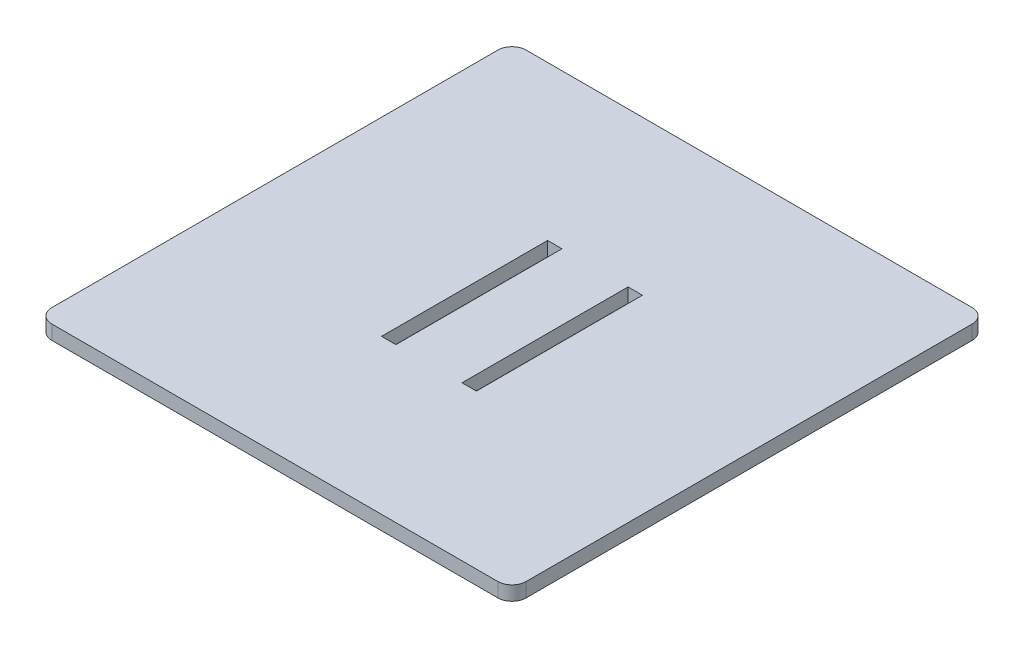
from build123d import *

# Parameters (mm, degrees)
IZIM1_W                     = 200
IZIM1_H                     = 200
IZIM1_W_2                   = 6.07
IZIM1_H_2                   = 70
Y_KSEKLIK_EKSTR_ZYON1_DEPTH = 6
RADYUS1_R                   = 6


with BuildPart() as part:
    # izim1 → Y_kseklik-Ekstr_zyon1 (new body)
    with BuildSketch(Plane(origin=(0, 0, 0), x_dir=(1, 0, 0), z_dir=(0, 1, 0))):
        Rectangle(IZIM1_W, IZIM1_H)
        with Locations((-16.965, 0)):
            Rectangle(IZIM1_W_2, IZIM1_H_2, mode=Mode.SUBTRACT)
        with Locations((16.965, 0)):
            Rectangle(IZIM1_W_2, IZIM1_H_2, mode=Mode.SUBTRACT)
    extrude(amount=Y_KSEKLIK_EKSTR_ZYON1_DEPTH)

    # Radyus1
    radyus1_edges = [part.edges().sort_by_distance(p)[0] for p in [
        (100, 3, 100),
        (-100, 3, 100),
        (-100, 3, -100),
        (100, 3, -100),
    ]]
    fillet(radyus1_edges, radius=RADYUS1_R)


solid = part.part
